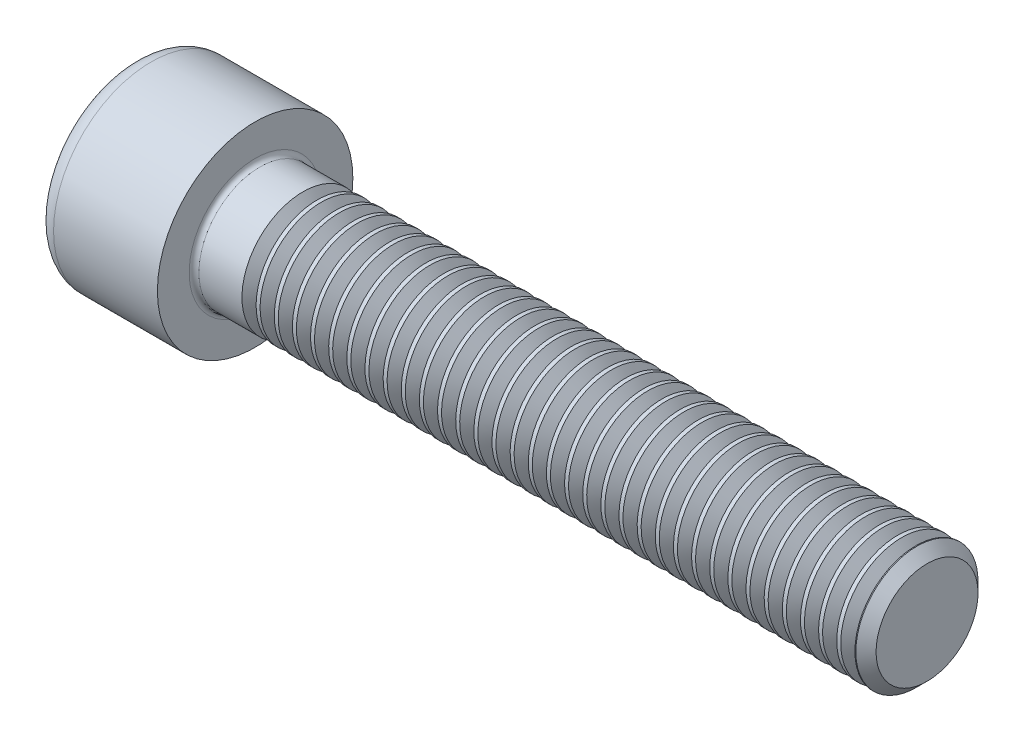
from build123d import *

# Parameters (mm, degrees)
FILLET1_R       = 0.4
FILLET2_R       = 1.5
HEX_2_DEPTH     = 5
THDSCHPAT_COUNT = 34
THDSCHPAT_PITCH = 1.485294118


with BuildPart() as part:
    # BodySke → Base-Revolve (revolve)
    with BuildSketch(Plane.XY, mode=Mode.PRIVATE) as base_revolve_sk:
        Polygon((0, 0), (0, 8), (10, 8), (10, 5), (64.172, 5), (65, 4.172), (65, 0), align=None)
    revolve(base_revolve_sk.sketch.rotate(Axis((-31.75, 0, 0), (1, 0, 0)), 180), axis=Axis((-31.75, 0, 0), (1, 0, 0)))

    # Fillet1
    fillet1_edges = [part.edges().sort_by_distance(p)[0] for p in [
        (10, 5, 0),
    ]]
    fillet(fillet1_edges, radius=FILLET1_R)

    # Fillet2
    fillet2_edges = [part.edges().sort_by_distance(p)[0] for p in [
        (0, 8, 0),
    ]]
    fillet(fillet2_edges, radius=FILLET2_R)

    # Sketch2 → Hex-PreBroach (revolve, cut)
    with BuildSketch(Plane.XY, mode=Mode.PRIVATE) as hex_prebroach_sk:
        Polygon((0, 4.0575), (5, 4.0575), (7.342598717, 0), (0, 0), align=None)
    revolve(hex_prebroach_sk.sketch.rotate(Axis((0, 0, 0), (1, 0, 0)), 180), axis=Axis((0, 0, 0), (1, 0, 0)), mode=Mode.SUBTRACT)

    # Sketch3 → Hex 2 (cut)
    with BuildSketch(Plane(origin=(0, 0, 0), x_dir=(0, 0.500000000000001, 0.866025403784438), z_dir=(-1, 0, 0))):
        Polygon((2.342598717, 4.0575), (-2.342598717, 4.0575), (-4.685197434, 0), (-2.342598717, -4.0575), (2.342598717, -4.0575), (4.685197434, 0), align=None)
    extrude(amount=-HEX_2_DEPTH, mode=Mode.SUBTRACT)

    # ThdSchSke → ThreadSchematic (revolve, cut)
    with BuildSketch(Plane.XY):
        Polygon((14.5, -4.172), (13.920228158, -5), (13.920228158, -6.25), (15.079771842, -6.25), (15.079771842, -5), align=None)
    threadschematic = revolve(axis=Axis((-3.175, 0, 0), (1, 0, 0)), mode=Mode.SUBTRACT)

    # ThdSchPat: ThreadSchematic ×34
    with Locations(*[(i * THDSCHPAT_PITCH, 0, 0) for i in range(1, THDSCHPAT_COUNT)]):
        add(threadschematic, mode=Mode.SUBTRACT)


solid = part.part
